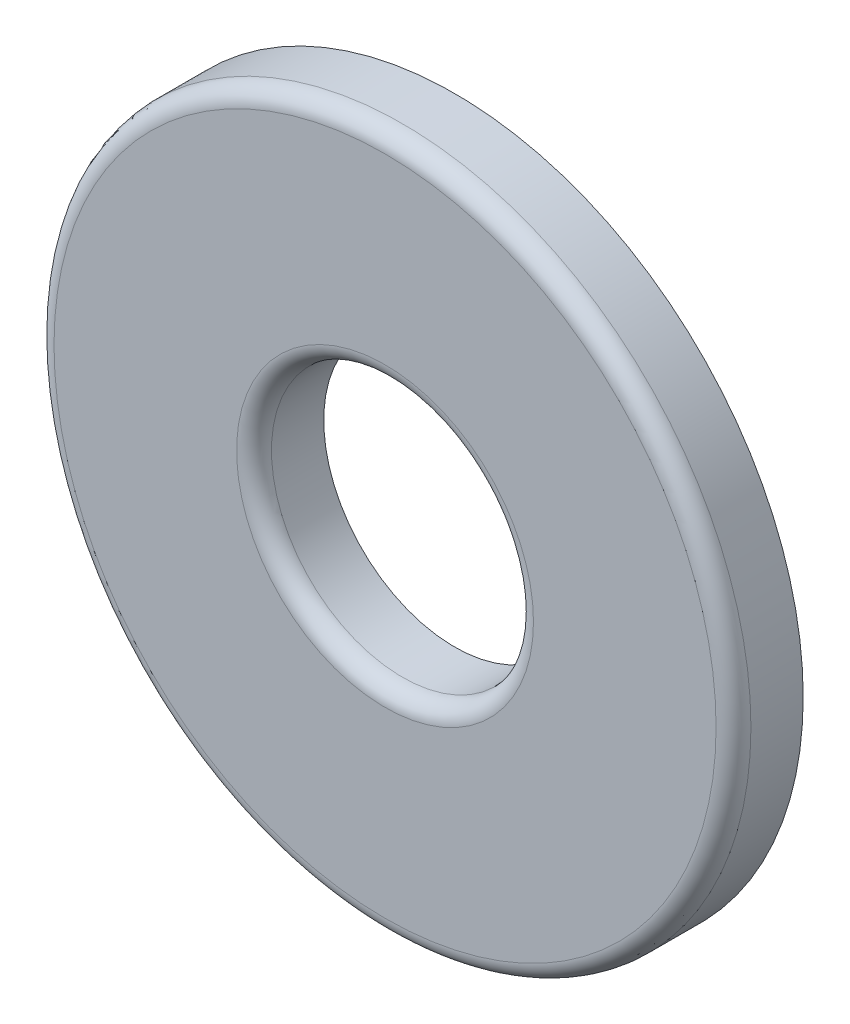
ISO-10303-21;
HEADER;
FILE_DESCRIPTION(('STEP AP214'),'2;1');
FILE_NAME('part.step','',(''),(''),'','','');
FILE_SCHEMA(('AUTOMOTIVE_DESIGN { 1 0 10303 214 1 1 1 1 }'));
ENDSEC;
DATA;
#1=APPLICATION_CONTEXT('core data for automotive mechanical design processes');
#2=APPLICATION_PROTOCOL_DEFINITION('international standard','automotive_design',2000,#1);
#3=PRODUCT_CONTEXT('',#1,'mechanical');
#4=PRODUCT('Part','Part','',(#3));
#5=PRODUCT_RELATED_PRODUCT_CATEGORY('part','',(#4));
#6=PRODUCT_DEFINITION_FORMATION('','',#4);
#7=PRODUCT_DEFINITION_CONTEXT('part definition',#1,'design');
#8=PRODUCT_DEFINITION('design','',#6,#7);
#9=PRODUCT_DEFINITION_SHAPE('','',#8);
#10=(LENGTH_UNIT() NAMED_UNIT(*) SI_UNIT(.MILLI.,.METRE.));
#11=(NAMED_UNIT(*) PLANE_ANGLE_UNIT() SI_UNIT($,.RADIAN.));
#12=(NAMED_UNIT(*) SI_UNIT($,.STERADIAN.) SOLID_ANGLE_UNIT());
#13=UNCERTAINTY_MEASURE_WITH_UNIT(LENGTH_MEASURE(1.E-05),#10,'distance_accuracy_value','');
#14=(GEOMETRIC_REPRESENTATION_CONTEXT(3) GLOBAL_UNCERTAINTY_ASSIGNED_CONTEXT((#13)) GLOBAL_UNIT_ASSIGNED_CONTEXT((#10,
#11,#12)) REPRESENTATION_CONTEXT('',''));
#15=CARTESIAN_POINT('',(0.,0.,0.));
#16=DIRECTION('',(0.,0.,1.));
#17=DIRECTION('',(1.,0.,0.));
#18=AXIS2_PLACEMENT_3D('',#15,#16,#17);
#19=CARTESIAN_POINT('',(0.,0.,0.317499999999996));
#20=DIRECTION('',(0.,0.,1.));
#21=DIRECTION('',(1.,0.,0.));
#22=AXIS2_PLACEMENT_3D('',#19,#20,#21);
#23=PLANE('',#22);
#24=CARTESIAN_POINT('',(0.,0.,0.317499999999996));
#25=DIRECTION('',(0.,0.,1.));
#26=DIRECTION('',(1.,0.,0.));
#27=AXIS2_PLACEMENT_3D('',#24,#25,#26);
#28=CIRCLE('',#27,3.01625);
#29=CARTESIAN_POINT('',(3.01625,0.,0.317499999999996));
#30=VERTEX_POINT('',#29);
#31=EDGE_CURVE('E55',#30,#30,#28,.T.);
#32=ORIENTED_EDGE('',*,*,#31,.T.);
#33=EDGE_LOOP('',(#32));
#34=FACE_BOUND('',#33,.T.);
#35=CARTESIAN_POINT('',(0.,0.,0.317499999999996));
#36=DIRECTION('',(0.,0.,1.));
#37=DIRECTION('',(1.,0.,0.));
#38=AXIS2_PLACEMENT_3D('',#35,#36,#37);
#39=CIRCLE('',#38,1.35255);
#40=CARTESIAN_POINT('',(1.35255,0.,0.317499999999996));
#41=VERTEX_POINT('',#40);
#42=EDGE_CURVE('E61',#41,#41,#39,.F.);
#43=ORIENTED_EDGE('',*,*,#42,.T.);
#44=EDGE_LOOP('',(#43));
#45=FACE_BOUND('',#44,.T.);
#46=ADVANCED_FACE('F41',(#34,#45),#23,.T.);
#47=CARTESIAN_POINT('',(0.,0.,0.317499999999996));
#48=DIRECTION('',(0.,0.,-1.));
#49=DIRECTION('',(-1.,0.,0.));
#50=AXIS2_PLACEMENT_3D('',#47,#48,#49);
#51=CYLINDRICAL_SURFACE('',#50,3.175);
#52=CARTESIAN_POINT('',(0.,0.,0.158749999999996));
#53=DIRECTION('',(0.,0.,1.));
#54=DIRECTION('',(1.,0.,0.));
#55=AXIS2_PLACEMENT_3D('',#52,#53,#54);
#56=CIRCLE('',#55,3.175);
#57=CARTESIAN_POINT('',(3.175,0.,0.158749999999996));
#58=VERTEX_POINT('',#57);
#59=EDGE_CURVE('E49',#58,#58,#56,.F.);
#60=ORIENTED_EDGE('',*,*,#59,.T.);
#61=EDGE_LOOP('',(#60));
#62=FACE_BOUND('',#61,.T.);
#63=CARTESIAN_POINT('',(0.,0.,-0.317500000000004));
#64=DIRECTION('',(0.,0.,1.));
#65=DIRECTION('',(1.,0.,0.));
#66=AXIS2_PLACEMENT_3D('',#63,#64,#65);
#67=CIRCLE('',#66,3.175);
#68=CARTESIAN_POINT('',(3.175,0.,-0.317500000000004));
#69=VERTEX_POINT('',#68);
#70=EDGE_CURVE('E67',#69,#69,#67,.T.);
#71=ORIENTED_EDGE('',*,*,#70,.T.);
#72=EDGE_LOOP('',(#71));
#73=FACE_BOUND('',#72,.T.);
#74=ADVANCED_FACE('F82',(#62,#73),#51,.T.);
#75=CARTESIAN_POINT('',(0.,0.,0.317499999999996));
#76=DIRECTION('',(0.,0.,-1.));
#77=DIRECTION('',(-1.,0.,0.));
#78=AXIS2_PLACEMENT_3D('',#75,#76,#77);
#79=CYLINDRICAL_SURFACE('',#78,1.1938);
#80=CARTESIAN_POINT('',(0.,0.,0.158749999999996));
#81=DIRECTION('',(0.,0.,1.));
#82=DIRECTION('',(1.,0.,0.));
#83=AXIS2_PLACEMENT_3D('',#80,#81,#82);
#84=CIRCLE('',#83,1.1938);
#85=CARTESIAN_POINT('',(1.1938,0.,0.158749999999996));
#86=VERTEX_POINT('',#85);
#87=EDGE_CURVE('E10',#86,#86,#84,.T.);
#88=ORIENTED_EDGE('',*,*,#87,.T.);
#89=EDGE_LOOP('',(#88));
#90=FACE_BOUND('',#89,.T.);
#91=CARTESIAN_POINT('',(0.,0.,-0.317500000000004));
#92=DIRECTION('',(0.,0.,1.));
#93=DIRECTION('',(1.,0.,0.));
#94=AXIS2_PLACEMENT_3D('',#91,#92,#93);
#95=CIRCLE('',#94,1.1938);
#96=CARTESIAN_POINT('',(1.1938,0.,-0.317500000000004));
#97=VERTEX_POINT('',#96);
#98=EDGE_CURVE('E71',#97,#97,#95,.T.);
#99=ORIENTED_EDGE('',*,*,#98,.F.);
#100=EDGE_LOOP('',(#99));
#101=FACE_BOUND('',#100,.T.);
#102=ADVANCED_FACE('F80',(#90,#101),#79,.F.);
#103=CARTESIAN_POINT('',(0.,0.,-0.317500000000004));
#104=DIRECTION('',(0.,0.,1.));
#105=DIRECTION('',(1.,0.,0.));
#106=AXIS2_PLACEMENT_3D('',#103,#104,#105);
#107=PLANE('',#106);
#108=ORIENTED_EDGE('',*,*,#98,.T.);
#109=EDGE_LOOP('',(#108));
#110=FACE_BOUND('',#109,.T.);
#111=ORIENTED_EDGE('',*,*,#70,.F.);
#112=EDGE_LOOP('',(#111));
#113=FACE_BOUND('',#112,.T.);
#114=ADVANCED_FACE('F77',(#110,#113),#107,.F.);
#115=CARTESIAN_POINT('',(0.,0.,0.158749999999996));
#116=DIRECTION('',(0.,0.,1.));
#117=DIRECTION('',(1.,0.,0.));
#118=AXIS2_PLACEMENT_3D('',#115,#116,#117);
#119=TOROIDAL_SURFACE('',#118,3.01625,0.15875);
#120=ORIENTED_EDGE('',*,*,#59,.F.);
#121=EDGE_LOOP('',(#120));
#122=FACE_BOUND('',#121,.T.);
#123=ORIENTED_EDGE('',*,*,#31,.F.);
#124=EDGE_LOOP('',(#123));
#125=FACE_BOUND('',#124,.T.);
#126=ADVANCED_FACE('F88',(#122,#125),#119,.T.);
#127=CARTESIAN_POINT('',(0.,0.,0.158749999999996));
#128=DIRECTION('',(0.,0.,1.));
#129=DIRECTION('',(1.,0.,0.));
#130=AXIS2_PLACEMENT_3D('',#127,#128,#129);
#131=TOROIDAL_SURFACE('',#130,1.35255,0.15875);
#132=ORIENTED_EDGE('',*,*,#42,.F.);
#133=EDGE_LOOP('',(#132));
#134=FACE_BOUND('',#133,.T.);
#135=ORIENTED_EDGE('',*,*,#87,.F.);
#136=EDGE_LOOP('',(#135));
#137=FACE_BOUND('',#136,.T.);
#138=ADVANCED_FACE('F43',(#134,#137),#131,.T.);
#139=CLOSED_SHELL('',(#46,#74,#102,#114,#126,#138));
#140=MANIFOLD_SOLID_BREP('B2',#139);
#141=ADVANCED_BREP_SHAPE_REPRESENTATION('',(#18,#140),#14);
#142=SHAPE_DEFINITION_REPRESENTATION(#9,#141);
ENDSEC;
END-ISO-10303-21;
